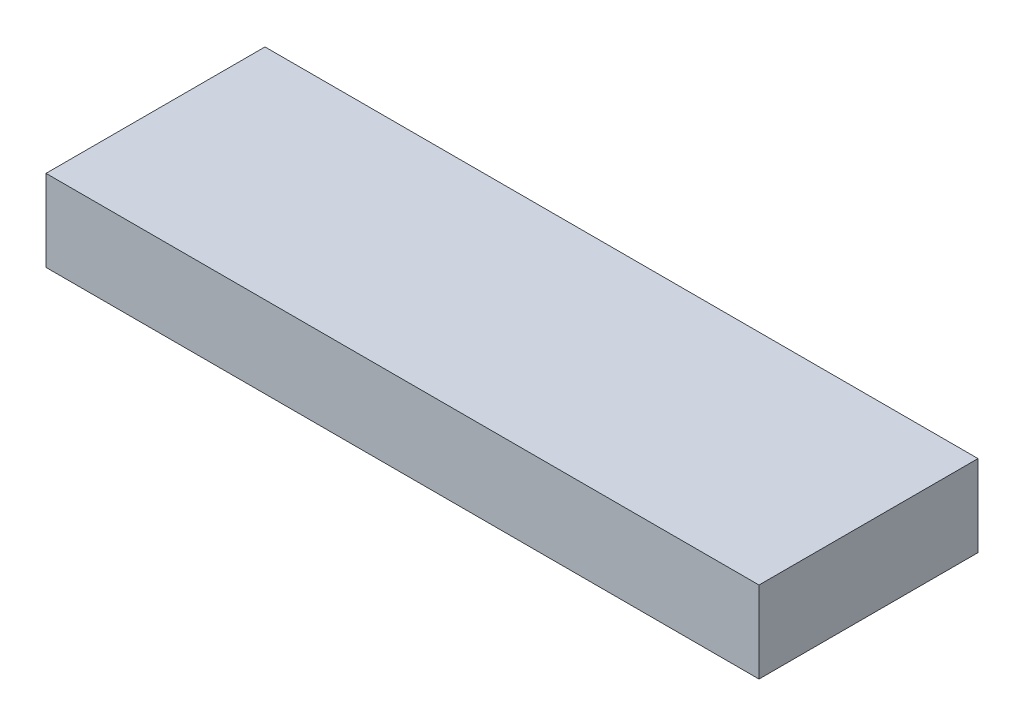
ISO-10303-21;
HEADER;
FILE_DESCRIPTION(('STEP AP214'),'2;1');
FILE_NAME('part.step','',(''),(''),'','','');
FILE_SCHEMA(('AUTOMOTIVE_DESIGN { 1 0 10303 214 1 1 1 1 }'));
ENDSEC;
DATA;
#1=APPLICATION_CONTEXT('core data for automotive mechanical design processes');
#2=APPLICATION_PROTOCOL_DEFINITION('international standard','automotive_design',2000,#1);
#3=PRODUCT_CONTEXT('',#1,'mechanical');
#4=PRODUCT('Part','Part','',(#3));
#5=PRODUCT_RELATED_PRODUCT_CATEGORY('part','',(#4));
#6=PRODUCT_DEFINITION_FORMATION('','',#4);
#7=PRODUCT_DEFINITION_CONTEXT('part definition',#1,'design');
#8=PRODUCT_DEFINITION('design','',#6,#7);
#9=PRODUCT_DEFINITION_SHAPE('','',#8);
#10=(LENGTH_UNIT() NAMED_UNIT(*) SI_UNIT(.MILLI.,.METRE.));
#11=(NAMED_UNIT(*) PLANE_ANGLE_UNIT() SI_UNIT($,.RADIAN.));
#12=(NAMED_UNIT(*) SI_UNIT($,.STERADIAN.) SOLID_ANGLE_UNIT());
#13=UNCERTAINTY_MEASURE_WITH_UNIT(LENGTH_MEASURE(1.E-05),#10,'distance_accuracy_value','');
#14=(GEOMETRIC_REPRESENTATION_CONTEXT(3) GLOBAL_UNCERTAINTY_ASSIGNED_CONTEXT((#13)) GLOBAL_UNIT_ASSIGNED_CONTEXT((#10,
#11,#12)) REPRESENTATION_CONTEXT('',''));
#15=CARTESIAN_POINT('',(0.,0.,0.));
#16=DIRECTION('',(0.,0.,1.));
#17=DIRECTION('',(1.,0.,0.));
#18=AXIS2_PLACEMENT_3D('',#15,#16,#17);
#19=CARTESIAN_POINT('',(-70.,8.,21.5));
#20=DIRECTION('',(1.,0.,0.));
#21=DIRECTION('',(0.,0.,-1.));
#22=AXIS2_PLACEMENT_3D('',#19,#20,#21);
#23=PLANE('',#22);
#24=DIRECTION('',(0.,0.,1.));
#25=VECTOR('',#24,1.);
#26=CARTESIAN_POINT('',(-70.,-8.,21.5));
#27=LINE('',#26,#25);
#28=CARTESIAN_POINT('',(-70.,-8.,-21.5));
#29=VERTEX_POINT('',#28);
#30=CARTESIAN_POINT('',(-70.,-8.,21.5));
#31=VERTEX_POINT('',#30);
#32=EDGE_CURVE('E97',#29,#31,#27,.T.);
#33=ORIENTED_EDGE('',*,*,#32,.T.);
#34=DIRECTION('',(0.,-1.,0.));
#35=VECTOR('',#34,1.);
#36=CARTESIAN_POINT('',(-70.,8.,21.5));
#37=LINE('',#36,#35);
#38=CARTESIAN_POINT('',(-70.,8.,21.5));
#39=VERTEX_POINT('',#38);
#40=EDGE_CURVE('E11',#39,#31,#37,.T.);
#41=ORIENTED_EDGE('',*,*,#40,.F.);
#42=DIRECTION('',(0.,0.,1.));
#43=VECTOR('',#42,1.);
#44=CARTESIAN_POINT('',(-70.,8.,21.5));
#45=LINE('',#44,#43);
#46=CARTESIAN_POINT('',(-70.,8.,-21.5));
#47=VERTEX_POINT('',#46);
#48=EDGE_CURVE('E85',#47,#39,#45,.T.);
#49=ORIENTED_EDGE('',*,*,#48,.F.);
#50=DIRECTION('',(0.,-1.,0.));
#51=VECTOR('',#50,1.);
#52=CARTESIAN_POINT('',(-70.,8.,-21.5));
#53=LINE('',#52,#51);
#54=EDGE_CURVE('E93',#47,#29,#53,.T.);
#55=ORIENTED_EDGE('',*,*,#54,.T.);
#56=EDGE_LOOP('',(#33,#41,#49,#55));
#57=FACE_BOUND('',#56,.T.);
#58=ADVANCED_FACE('F34',(#57),#23,.F.);
#59=CARTESIAN_POINT('',(70.,8.,21.5));
#60=DIRECTION('',(0.,0.,-1.));
#61=DIRECTION('',(-1.,0.,0.));
#62=AXIS2_PLACEMENT_3D('',#59,#60,#61);
#63=PLANE('',#62);
#64=DIRECTION('',(1.,0.,0.));
#65=VECTOR('',#64,1.);
#66=CARTESIAN_POINT('',(70.,-8.,21.5));
#67=LINE('',#66,#65);
#68=CARTESIAN_POINT('',(70.,-8.,21.5));
#69=VERTEX_POINT('',#68);
#70=EDGE_CURVE('E89',#31,#69,#67,.T.);
#71=ORIENTED_EDGE('',*,*,#70,.T.);
#72=DIRECTION('',(0.,-1.,0.));
#73=VECTOR('',#72,1.);
#74=CARTESIAN_POINT('',(70.,8.,21.5));
#75=LINE('',#74,#73);
#76=CARTESIAN_POINT('',(70.,8.,21.5));
#77=VERTEX_POINT('',#76);
#78=EDGE_CURVE('E42',#77,#69,#75,.T.);
#79=ORIENTED_EDGE('',*,*,#78,.F.);
#80=DIRECTION('',(1.,0.,0.));
#81=VECTOR('',#80,1.);
#82=CARTESIAN_POINT('',(70.,8.,21.5));
#83=LINE('',#82,#81);
#84=EDGE_CURVE('E80',#39,#77,#83,.T.);
#85=ORIENTED_EDGE('',*,*,#84,.F.);
#86=ORIENTED_EDGE('',*,*,#40,.T.);
#87=EDGE_LOOP('',(#71,#79,#85,#86));
#88=FACE_BOUND('',#87,.T.);
#89=ADVANCED_FACE('F88',(#88),#63,.F.);
#90=CARTESIAN_POINT('',(70.,8.,21.5));
#91=DIRECTION('',(-1.,0.,0.));
#92=DIRECTION('',(0.,0.,1.));
#93=AXIS2_PLACEMENT_3D('',#90,#91,#92);
#94=PLANE('',#93);
#95=DIRECTION('',(0.,0.,-1.));
#96=VECTOR('',#95,1.);
#97=CARTESIAN_POINT('',(70.,-8.,21.5));
#98=LINE('',#97,#96);
#99=CARTESIAN_POINT('',(70.,-8.,-21.5));
#100=VERTEX_POINT('',#99);
#101=EDGE_CURVE('E67',#69,#100,#98,.T.);
#102=ORIENTED_EDGE('',*,*,#101,.T.);
#103=DIRECTION('',(0.,-1.,0.));
#104=VECTOR('',#103,1.);
#105=CARTESIAN_POINT('',(70.,8.,-21.5));
#106=LINE('',#105,#104);
#107=CARTESIAN_POINT('',(70.,8.,-21.5));
#108=VERTEX_POINT('',#107);
#109=EDGE_CURVE('E90',#108,#100,#106,.T.);
#110=ORIENTED_EDGE('',*,*,#109,.F.);
#111=DIRECTION('',(0.,0.,-1.));
#112=VECTOR('',#111,1.);
#113=CARTESIAN_POINT('',(70.,8.,21.5));
#114=LINE('',#113,#112);
#115=EDGE_CURVE('E83',#77,#108,#114,.T.);
#116=ORIENTED_EDGE('',*,*,#115,.F.);
#117=ORIENTED_EDGE('',*,*,#78,.T.);
#118=EDGE_LOOP('',(#102,#110,#116,#117));
#119=FACE_BOUND('',#118,.T.);
#120=ADVANCED_FACE('F91',(#119),#94,.F.);
#121=CARTESIAN_POINT('',(70.,8.,-21.5));
#122=DIRECTION('',(0.,0.,1.));
#123=DIRECTION('',(1.,0.,0.));
#124=AXIS2_PLACEMENT_3D('',#121,#122,#123);
#125=PLANE('',#124);
#126=DIRECTION('',(-1.,0.,0.));
#127=VECTOR('',#126,1.);
#128=CARTESIAN_POINT('',(70.,-8.,-21.5));
#129=LINE('',#128,#127);
#130=EDGE_CURVE('E73',#100,#29,#129,.T.);
#131=ORIENTED_EDGE('',*,*,#130,.T.);
#132=ORIENTED_EDGE('',*,*,#54,.F.);
#133=DIRECTION('',(-1.,0.,0.));
#134=VECTOR('',#133,1.);
#135=CARTESIAN_POINT('',(70.,8.,-21.5));
#136=LINE('',#135,#134);
#137=EDGE_CURVE('E50',#108,#47,#136,.T.);
#138=ORIENTED_EDGE('',*,*,#137,.F.);
#139=ORIENTED_EDGE('',*,*,#109,.T.);
#140=EDGE_LOOP('',(#131,#132,#138,#139));
#141=FACE_BOUND('',#140,.T.);
#142=ADVANCED_FACE('F104',(#141),#125,.F.);
#143=CARTESIAN_POINT('',(0.,8.,0.));
#144=DIRECTION('',(0.,1.,0.));
#145=DIRECTION('',(0.,0.,1.));
#146=AXIS2_PLACEMENT_3D('',#143,#144,#145);
#147=PLANE('',#146);
#148=ORIENTED_EDGE('',*,*,#48,.T.);
#149=ORIENTED_EDGE('',*,*,#84,.T.);
#150=ORIENTED_EDGE('',*,*,#115,.T.);
#151=ORIENTED_EDGE('',*,*,#137,.T.);
#152=EDGE_LOOP('',(#148,#149,#150,#151));
#153=FACE_BOUND('',#152,.T.);
#154=ADVANCED_FACE('F81',(#153),#147,.T.);
#155=CARTESIAN_POINT('',(0.,-8.,0.));
#156=DIRECTION('',(0.,1.,0.));
#157=DIRECTION('',(0.,0.,1.));
#158=AXIS2_PLACEMENT_3D('',#155,#156,#157);
#159=PLANE('',#158);
#160=ORIENTED_EDGE('',*,*,#32,.F.);
#161=ORIENTED_EDGE('',*,*,#130,.F.);
#162=ORIENTED_EDGE('',*,*,#101,.F.);
#163=ORIENTED_EDGE('',*,*,#70,.F.);
#164=EDGE_LOOP('',(#160,#161,#162,#163));
#165=FACE_BOUND('',#164,.T.);
#166=ADVANCED_FACE('F107',(#165),#159,.F.);
#167=CLOSED_SHELL('',(#58,#89,#120,#142,#154,#166));
#168=MANIFOLD_SOLID_BREP('B2',#167);
#169=ADVANCED_BREP_SHAPE_REPRESENTATION('',(#18,#168),#14);
#170=SHAPE_DEFINITION_REPRESENTATION(#9,#169);
ENDSEC;
END-ISO-10303-21;
